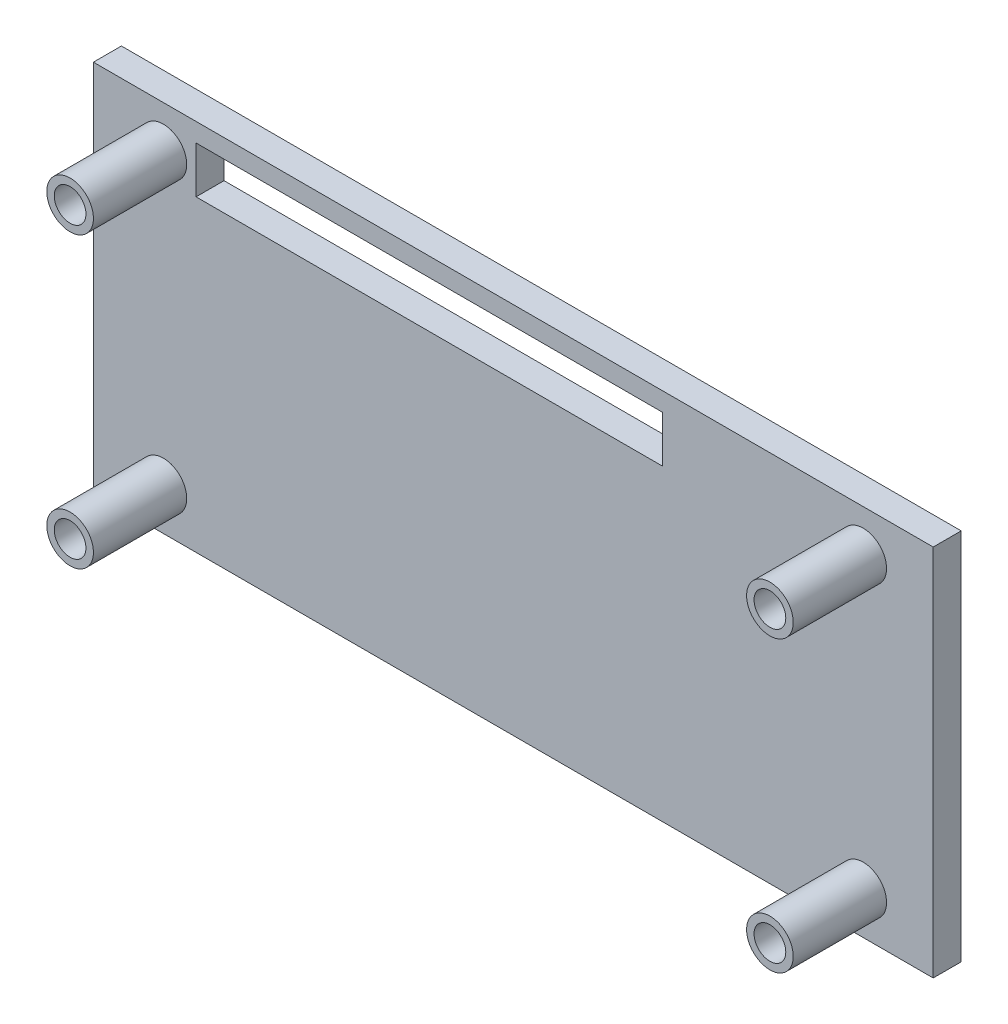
from build123d import *

# Parameters (mm, degrees)
SCHIZZO1_W                   = 90
SCHIZZO1_H                   = 40
ESTRUSIONE_ESTRUSIONE1_DEPTH = 3
SCHIZZO3_R                   = 2.5
ESTRUSIONE_ESTRUSIONE2_DEPTH = 10
FORO_PER_VITE_M3_1_D         = 3.4
SCHIZZO6_W                   = 50
SCHIZZO6_H                   = 5
TAGLIO_ESTRUSIONE1_DEPTH     = 51.249378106


with BuildPart() as part:
    # Schizzo1 → Estrusione-Estrusione1 (new body)
    with BuildSketch(Plane.XY):
        Rectangle(SCHIZZO1_W, SCHIZZO1_H)
    extrude(amount=ESTRUSIONE_ESTRUSIONE1_DEPTH)

    # Schizzo3 → Estrusione-Estrusione2 (add)
    with BuildSketch(Plane.XY.offset(3)):
        with Locations((-37.5, 15.5)):
            Circle(SCHIZZO3_R)
        with Locations((-37.5, -15.5)):
            Circle(SCHIZZO3_R)
        with Locations((37.5, -15.5)):
            Circle(SCHIZZO3_R)
        with Locations((37.5, 15.5)):
            Circle(SCHIZZO3_R)
    extrude(amount=ESTRUSIONE_ESTRUSIONE2_DEPTH)

    # Foro per Vite M3-1 (through all)
    with Locations(Plane.XY.offset(13)):
        with Locations((-37.5, 15.5), (-37.5, -15.5), (37.5, 15.5), (37.5, -15.5)):
            Hole(FORO_PER_VITE_M3_1_D / 2)

    # Schizzo6 → Taglio-Estrusione1 (cut, through all)
    with BuildSketch(Plane.XY.offset(3)):
        with Locations((-9, 15.5)):
            Rectangle(SCHIZZO6_W, SCHIZZO6_H)
    extrude(amount=-TAGLIO_ESTRUSIONE1_DEPTH, mode=Mode.SUBTRACT)


solid = part.part
